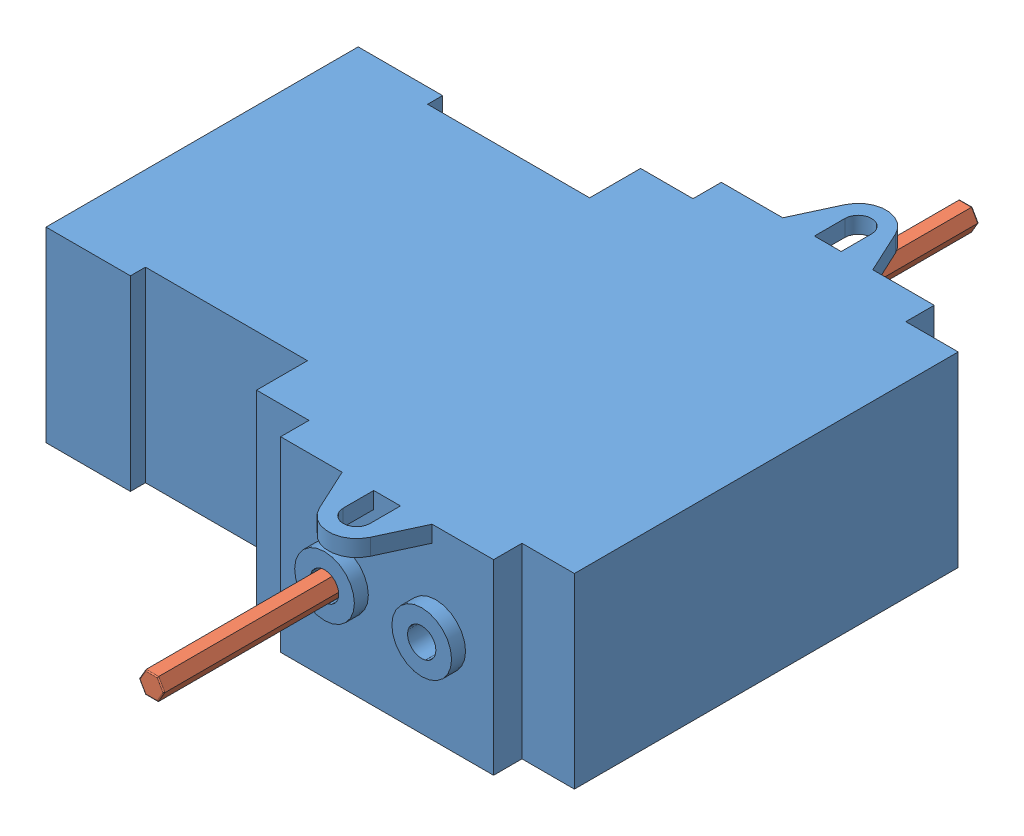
SolidWorks assembly Motor Assem.SLDASM, configuration Default (file format 4400). Lengths in mm.
Overall size (69.6 23.04 100.48).
2 component instances, 2 part files, 2 mates.
Components (placement in the parent):
- Motor Blank-1: Motor Blank.SLDPRT [Default] at (5.7776 0.4066 -11.1507) size (69.6 23.04 68.78)
- Motor Shaft-1: Motor Shaft.SLDPRT [Default] at (14.9851 11.9255 -61.3919) x (0 0 -1) z (1 0 0) size (100.48 2.67 3.08)
Mates (geometry in assembly coordinates):
- Concentric1: concentric: cylinder of Motor Blank-1 through (14.9851 11.9255 -40.0559) axis (0 0 1) radius 1.7526; circle of Motor Shaft-1
- Distance1: distance = 21.336 mm aligned: plane of Motor Shaft-1 through (13.4453 11.9255 39.0905) normal (0 0 1); plane of Motor Blank-1 through (14.9851 11.9255 17.7545) normal (0 0 1)
